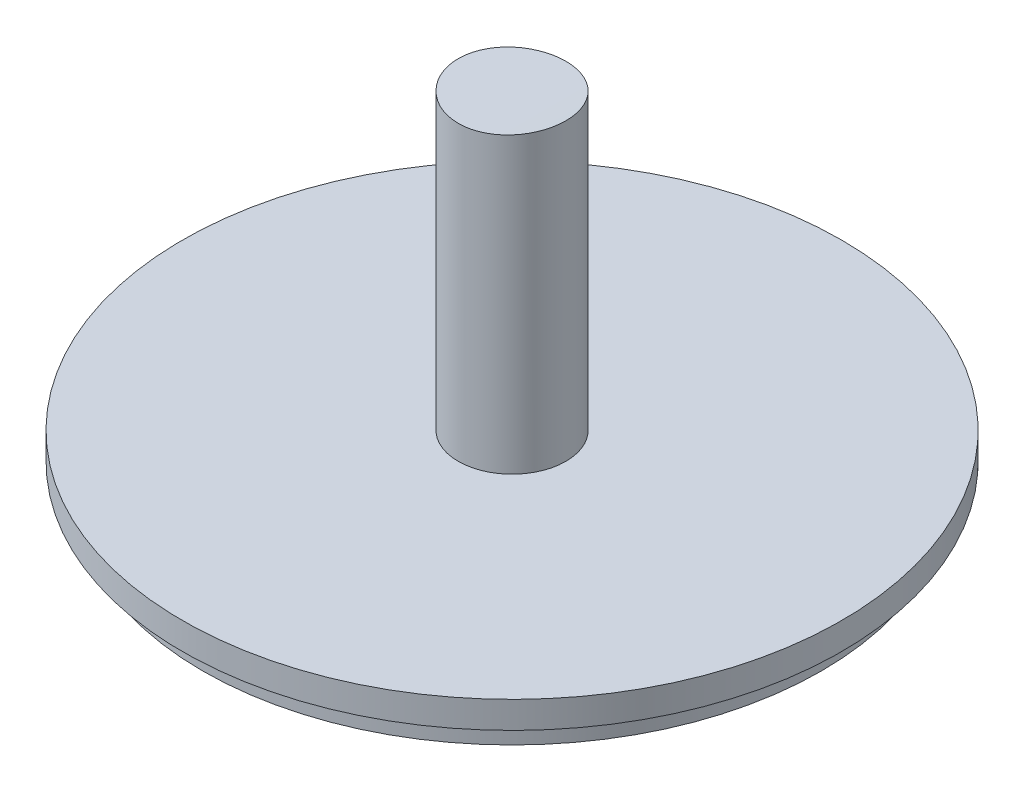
ISO-10303-21;
HEADER;
FILE_DESCRIPTION(('STEP AP214'),'2;1');
FILE_NAME('part.step','',(''),(''),'','','');
FILE_SCHEMA(('AUTOMOTIVE_DESIGN { 1 0 10303 214 1 1 1 1 }'));
ENDSEC;
DATA;
#1=APPLICATION_CONTEXT('core data for automotive mechanical design processes');
#2=APPLICATION_PROTOCOL_DEFINITION('international standard','automotive_design',2000,#1);
#3=PRODUCT_CONTEXT('',#1,'mechanical');
#4=PRODUCT('Part','Part','',(#3));
#5=PRODUCT_RELATED_PRODUCT_CATEGORY('part','',(#4));
#6=PRODUCT_DEFINITION_FORMATION('','',#4);
#7=PRODUCT_DEFINITION_CONTEXT('part definition',#1,'design');
#8=PRODUCT_DEFINITION('design','',#6,#7);
#9=PRODUCT_DEFINITION_SHAPE('','',#8);
#10=(LENGTH_UNIT() NAMED_UNIT(*) SI_UNIT(.MILLI.,.METRE.));
#11=(NAMED_UNIT(*) PLANE_ANGLE_UNIT() SI_UNIT($,.RADIAN.));
#12=(NAMED_UNIT(*) SI_UNIT($,.STERADIAN.) SOLID_ANGLE_UNIT());
#13=UNCERTAINTY_MEASURE_WITH_UNIT(LENGTH_MEASURE(1.E-05),#10,'distance_accuracy_value','');
#14=(GEOMETRIC_REPRESENTATION_CONTEXT(3) GLOBAL_UNCERTAINTY_ASSIGNED_CONTEXT((#13)) GLOBAL_UNIT_ASSIGNED_CONTEXT((#10,
#11,#12)) REPRESENTATION_CONTEXT('',''));
#15=CARTESIAN_POINT('',(0.,0.,0.));
#16=DIRECTION('',(0.,0.,1.));
#17=DIRECTION('',(1.,0.,0.));
#18=AXIS2_PLACEMENT_3D('',#15,#16,#17);
#19=CARTESIAN_POINT('',(0.,0.,0.));
#20=DIRECTION('',(0.,-1.,0.));
#21=DIRECTION('',(0.,0.,-1.));
#22=AXIS2_PLACEMENT_3D('',#19,#20,#21);
#23=PLANE('',#22);
#24=CARTESIAN_POINT('',(0.,0.,0.));
#25=DIRECTION('',(0.,-1.,0.));
#26=DIRECTION('',(0.,0.,-1.));
#27=AXIS2_PLACEMENT_3D('',#24,#25,#26);
#28=CIRCLE('',#27,72.9996);
#29=CARTESIAN_POINT('',(0.,0.,-72.9996));
#30=VERTEX_POINT('',#29);
#31=EDGE_CURVE('E43',#30,#30,#28,.T.);
#32=ORIENTED_EDGE('',*,*,#31,.T.);
#33=EDGE_LOOP('',(#32));
#34=FACE_BOUND('',#33,.T.);
#35=ADVANCED_FACE('F31',(#34),#23,.T.);
#36=CARTESIAN_POINT('',(0.,0.,0.));
#37=DIRECTION('',(0.,-1.,0.));
#38=DIRECTION('',(0.,0.,-1.));
#39=AXIS2_PLACEMENT_3D('',#36,#37,#38);
#40=CYLINDRICAL_SURFACE('',#39,72.9996);
#41=CARTESIAN_POINT('',(0.,6.35000000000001,0.));
#42=DIRECTION('',(0.,-1.,0.));
#43=DIRECTION('',(0.,0.,-1.));
#44=AXIS2_PLACEMENT_3D('',#41,#42,#43);
#45=CIRCLE('',#44,72.9996);
#46=CARTESIAN_POINT('',(0.,6.35000000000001,-72.9996));
#47=VERTEX_POINT('',#46);
#48=EDGE_CURVE('E48',#47,#47,#45,.T.);
#49=ORIENTED_EDGE('',*,*,#48,.T.);
#50=EDGE_LOOP('',(#49));
#51=FACE_BOUND('',#50,.T.);
#52=ORIENTED_EDGE('',*,*,#31,.F.);
#53=EDGE_LOOP('',(#52));
#54=FACE_BOUND('',#53,.T.);
#55=ADVANCED_FACE('F59',(#51,#54),#40,.T.);
#56=CARTESIAN_POINT('',(72.9996,6.35000000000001,0.));
#57=DIRECTION('',(0.,-1.,0.));
#58=DIRECTION('',(0.,0.,-1.));
#59=AXIS2_PLACEMENT_3D('',#56,#57,#58);
#60=PLANE('',#59);
#61=CARTESIAN_POINT('',(0.,6.35000000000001,0.));
#62=DIRECTION('',(0.,-1.,0.));
#63=DIRECTION('',(0.,0.,-1.));
#64=AXIS2_PLACEMENT_3D('',#61,#62,#63);
#65=CIRCLE('',#64,77.7748);
#66=CARTESIAN_POINT('',(0.,6.35000000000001,-77.7748));
#67=VERTEX_POINT('',#66);
#68=EDGE_CURVE('E53',#67,#67,#65,.T.);
#69=ORIENTED_EDGE('',*,*,#68,.T.);
#70=EDGE_LOOP('',(#69));
#71=FACE_BOUND('',#70,.T.);
#72=ORIENTED_EDGE('',*,*,#48,.F.);
#73=EDGE_LOOP('',(#72));
#74=FACE_BOUND('',#73,.T.);
#75=ADVANCED_FACE('F62',(#71,#74),#60,.T.);
#76=CARTESIAN_POINT('',(0.,0.,0.));
#77=DIRECTION('',(0.,-1.,0.));
#78=DIRECTION('',(0.,0.,-1.));
#79=AXIS2_PLACEMENT_3D('',#76,#77,#78);
#80=CYLINDRICAL_SURFACE('',#79,77.7748);
#81=CARTESIAN_POINT('',(0.,12.7,0.));
#82=DIRECTION('',(0.,-1.,0.));
#83=DIRECTION('',(0.,0.,-1.));
#84=AXIS2_PLACEMENT_3D('',#81,#82,#83);
#85=CIRCLE('',#84,77.7748);
#86=CARTESIAN_POINT('',(0.,12.7,-77.7748));
#87=VERTEX_POINT('',#86);
#88=EDGE_CURVE('E50',#87,#87,#85,.T.);
#89=ORIENTED_EDGE('',*,*,#88,.T.);
#90=EDGE_LOOP('',(#89));
#91=FACE_BOUND('',#90,.T.);
#92=ORIENTED_EDGE('',*,*,#68,.F.);
#93=EDGE_LOOP('',(#92));
#94=FACE_BOUND('',#93,.T.);
#95=ADVANCED_FACE('F64',(#91,#94),#80,.T.);
#96=CARTESIAN_POINT('',(77.7748,12.7,0.));
#97=DIRECTION('',(0.,1.,0.));
#98=DIRECTION('',(0.,0.,1.));
#99=AXIS2_PLACEMENT_3D('',#96,#97,#98);
#100=PLANE('',#99);
#101=CARTESIAN_POINT('',(0.,12.7,0.));
#102=DIRECTION('',(0.,1.,0.));
#103=DIRECTION('',(0.,0.,1.));
#104=AXIS2_PLACEMENT_3D('',#101,#102,#103);
#105=CIRCLE('',#104,12.7);
#106=CARTESIAN_POINT('',(0.,12.7,12.7));
#107=VERTEX_POINT('',#106);
#108=EDGE_CURVE('E10',#107,#107,#105,.T.);
#109=ORIENTED_EDGE('',*,*,#108,.F.);
#110=EDGE_LOOP('',(#109));
#111=FACE_BOUND('',#110,.T.);
#112=ORIENTED_EDGE('',*,*,#88,.F.);
#113=EDGE_LOOP('',(#112));
#114=FACE_BOUND('',#113,.T.);
#115=ADVANCED_FACE('F71',(#111,#114),#100,.T.);
#116=CARTESIAN_POINT('',(0.,88.9,0.));
#117=DIRECTION('',(0.,-1.,0.));
#118=DIRECTION('',(0.,0.,-1.));
#119=AXIS2_PLACEMENT_3D('',#116,#117,#118);
#120=CYLINDRICAL_SURFACE('',#119,12.7);
#121=CARTESIAN_POINT('',(0.,81.7753,-12.7));
#122=CARTESIAN_POINT('',(0.356124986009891,81.7752992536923,-12.7000032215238));
#123=CARTESIAN_POINT('',(0.712199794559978,81.7765708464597,-12.6850148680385));
#124=CARTESIAN_POINT('',(1.42192775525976,81.781620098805,-12.6251708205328));
#125=CARTESIAN_POINT('',(1.77558028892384,81.7853983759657,-12.5803077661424));
#126=CARTESIAN_POINT('',(2.47817873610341,81.795360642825,-12.4609688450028));
#127=CARTESIAN_POINT('',(2.82711954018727,81.8015470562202,-12.3864631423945));
#128=CARTESIAN_POINT('',(3.51745523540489,81.8161499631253,-12.2083812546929));
#129=CARTESIAN_POINT('',(3.85885014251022,81.8245664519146,-12.1048051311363));
#130=CARTESIAN_POINT('',(4.53147572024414,81.8433860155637,-11.8693983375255));
#131=CARTESIAN_POINT('',(4.86271215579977,81.8537879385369,-11.7375840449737));
#132=CARTESIAN_POINT('',(5.51289312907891,81.8762880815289,-11.4466091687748));
#133=CARTESIAN_POINT('',(5.83183748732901,81.8883863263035,-11.287448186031));
#134=CARTESIAN_POINT('',(6.45511408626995,81.913935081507,-10.942954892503));
#135=CARTESIAN_POINT('',(6.75944955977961,81.9273852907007,-10.7576284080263));
#136=CARTESIAN_POINT('',(7.35144734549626,81.9552614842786,-10.3620919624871));
#137=CARTESIAN_POINT('',(7.63910968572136,81.969687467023,-10.1518820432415));
#138=CARTESIAN_POINT('',(8.19639522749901,81.9991435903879,-9.70754354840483));
#139=CARTESIAN_POINT('',(8.465974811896,82.0141750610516,-9.47336035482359));
#140=CARTESIAN_POINT('',(8.98446070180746,82.0443854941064,-8.9831371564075));
#141=CARTESIAN_POINT('',(9.23336695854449,82.0595644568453,-8.72709710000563));
#142=CARTESIAN_POINT('',(9.70876155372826,82.089641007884,-8.19495264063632));
#143=CARTESIAN_POINT('',(9.93524891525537,82.1045385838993,-7.91884736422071));
#144=CARTESIAN_POINT('',(10.3641921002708,82.133629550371,-7.34852616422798));
#145=CARTESIAN_POINT('',(10.5666479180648,82.1478229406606,-7.05431023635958));
#146=CARTESIAN_POINT('',(10.9463775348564,82.1751232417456,-6.44938318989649));
#147=CARTESIAN_POINT('',(11.1236128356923,82.1882284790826,-6.13864782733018));
#148=CARTESIAN_POINT('',(11.4512689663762,82.2129545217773,-5.50328979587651));
#149=CARTESIAN_POINT('',(11.6016897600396,82.224575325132,-5.17866710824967));
#150=CARTESIAN_POINT('',(11.874631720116,82.2459998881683,-4.517844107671));
#151=CARTESIAN_POINT('',(11.997153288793,82.2558036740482,-4.18164396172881));
#152=CARTESIAN_POINT('',(12.2134120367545,82.2733132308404,-3.50005680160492));
#153=CARTESIAN_POINT('',(12.30714928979,82.2810190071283,-3.1546698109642));
#154=CARTESIAN_POINT('',(12.4649664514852,82.2940952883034,-2.45801960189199));
#155=CARTESIAN_POINT('',(12.5291174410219,82.2994713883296,-2.10677259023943));
#156=CARTESIAN_POINT('',(12.6276285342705,82.3077612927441,-1.40009665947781));
#157=CARTESIAN_POINT('',(12.6619886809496,82.3106751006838,-1.04466774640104));
#158=CARTESIAN_POINT('',(12.7006670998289,82.3139568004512,-0.332173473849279));
#159=CARTESIAN_POINT('',(12.7049858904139,82.3143247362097,0.0248918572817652));
#160=CARTESIAN_POINT('',(12.6835513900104,82.312504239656,0.738111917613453));
#161=CARTESIAN_POINT('',(12.6577981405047,82.3103158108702,1.09426664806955));
#162=CARTESIAN_POINT('',(12.5765134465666,82.3034543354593,1.80220009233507));
#163=CARTESIAN_POINT('',(12.5210594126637,82.2987877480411,2.15398776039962));
#164=CARTESIAN_POINT('',(12.3808243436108,82.2871070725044,2.85162762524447));
#165=CARTESIAN_POINT('',(12.2960433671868,82.2800929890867,3.19747983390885));
#166=CARTESIAN_POINT('',(12.0977655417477,82.2639169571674,3.88080293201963));
#167=CARTESIAN_POINT('',(11.9842684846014,82.2547549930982,4.21827376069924));
#168=CARTESIAN_POINT('',(11.7293736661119,82.234543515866,4.88245016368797));
#169=CARTESIAN_POINT('',(11.5879758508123,82.2234939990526,5.20915571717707));
#170=CARTESIAN_POINT('',(11.278089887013,82.1998053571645,5.84991467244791));
#171=CARTESIAN_POINT('',(11.1095671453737,82.1871642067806,6.163951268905));
#172=CARTESIAN_POINT('',(10.7467606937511,82.1606617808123,6.77671847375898));
#173=CARTESIAN_POINT('',(10.5524769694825,82.1468005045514,7.07544907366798));
#174=CARTESIAN_POINT('',(10.1395200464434,82.1182495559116,7.65551353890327));
#175=CARTESIAN_POINT('',(9.92084641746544,82.1035598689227,7.93684709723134));
#176=CARTESIAN_POINT('',(9.46065316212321,82.0737669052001,8.48014026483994));
#177=CARTESIAN_POINT('',(9.21913348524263,82.0586636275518,8.74209983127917));
#178=CARTESIAN_POINT('',(8.71414780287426,82.0284214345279,9.24560217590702));
#179=CARTESIAN_POINT('',(8.45061491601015,82.0132825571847,9.48707788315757));
#180=CARTESIAN_POINT('',(7.90412455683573,81.9834458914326,9.94697719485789));
#181=CARTESIAN_POINT('',(7.62116704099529,81.9687481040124,10.1654007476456));
#182=CARTESIAN_POINT('',(7.0378229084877,81.9402099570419,10.5776466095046));
#183=CARTESIAN_POINT('',(6.73743625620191,81.926369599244,10.7714688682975));
#184=CARTESIAN_POINT('',(6.12135596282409,81.899938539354,11.1331302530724));
#185=CARTESIAN_POINT('',(5.80566233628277,81.887347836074,11.3009694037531));
#186=CARTESIAN_POINT('',(5.16116552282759,81.8637717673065,11.6094798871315));
#187=CARTESIAN_POINT('',(4.83236084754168,81.8527865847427,11.7501481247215));
#188=CARTESIAN_POINT('',(4.16401037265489,81.8327351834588,12.0032790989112));
#189=CARTESIAN_POINT('',(3.8244645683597,81.8236689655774,12.1157418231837));
#190=CARTESIAN_POINT('',(3.13705723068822,81.807713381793,12.3116447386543));
#191=CARTESIAN_POINT('',(2.78919584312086,81.8008239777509,12.3950854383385));
#192=CARTESIAN_POINT('',(2.08763817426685,81.7894179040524,12.5323390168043));
#193=CARTESIAN_POINT('',(1.73394190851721,81.784901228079,12.5861519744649));
#194=CARTESIAN_POINT('',(1.02434653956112,81.7783793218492,12.663637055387));
#195=CARTESIAN_POINT('',(0.66845761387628,81.7763663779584,12.6874017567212));
#196=CARTESIAN_POINT('',(-0.0440630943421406,81.7748834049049,12.7049225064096));
#197=CARTESIAN_POINT('',(-0.400694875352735,81.775413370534,12.6986786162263));
#198=CARTESIAN_POINT('',(-1.11215428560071,81.7790011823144,12.6562279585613));
#199=CARTESIAN_POINT('',(-1.46698193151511,81.782059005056,12.6200214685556));
#200=CARTESIAN_POINT('',(-2.17230765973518,81.7906158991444,12.5179094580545));
#201=CARTESIAN_POINT('',(-2.52280574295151,81.7961149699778,12.4520039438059));
#202=CARTESIAN_POINT('',(-3.21646684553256,81.8093889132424,12.2910910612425));
#203=CARTESIAN_POINT('',(-3.55963991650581,81.8171604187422,12.1961267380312));
#204=CARTESIAN_POINT('',(-4.23675580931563,81.834763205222,11.9777478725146));
#205=CARTESIAN_POINT('',(-4.57069864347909,81.844594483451,11.8543333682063));
#206=CARTESIAN_POINT('',(-5.2270043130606,81.8660401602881,11.5799367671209));
#207=CARTESIAN_POINT('',(-5.54936700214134,81.8776545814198,11.4289543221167));
#208=CARTESIAN_POINT('',(-6.18024323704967,81.9023398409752,11.1004984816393));
#209=CARTESIAN_POINT('',(-6.48875674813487,81.9154106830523,10.9230250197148));
#210=CARTESIAN_POINT('',(-7.09050134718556,81.9426745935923,10.5423832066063));
#211=CARTESIAN_POINT('',(-7.38369356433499,81.9568703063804,10.3391535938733));
#212=CARTESIAN_POINT('',(-7.95192788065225,81.9859556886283,9.90877753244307));
#213=CARTESIAN_POINT('',(-8.22696995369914,82.0008453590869,9.68163104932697));
#214=CARTESIAN_POINT('',(-8.75697615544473,82.0308988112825,9.20501964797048));
#215=CARTESIAN_POINT('',(-9.01193996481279,82.0460625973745,8.95555437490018));
#216=CARTESIAN_POINT('',(-9.49999241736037,82.0762360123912,8.43606313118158));
#217=CARTESIAN_POINT('',(-9.73308103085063,82.0912456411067,8.16603713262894));
#218=CARTESIAN_POINT('',(-10.1763095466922,82.1207244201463,7.60660271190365));
#219=CARTESIAN_POINT('',(-10.386388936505,82.1351920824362,7.31714626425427));
#220=CARTESIAN_POINT('',(-10.781415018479,82.1631344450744,6.72151733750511));
#221=CARTESIAN_POINT('',(-10.9663616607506,82.1766091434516,6.41534482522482));
#222=CARTESIAN_POINT('',(-11.3097990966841,82.2021812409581,5.78845220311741));
#223=CARTESIAN_POINT('',(-11.4682900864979,82.2142786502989,5.46773220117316));
#224=CARTESIAN_POINT('',(-11.7576785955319,82.2367504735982,4.81401759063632));
#225=CARTESIAN_POINT('',(-11.8885761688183,82.2471248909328,4.48102300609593));
#226=CARTESIAN_POINT('',(-12.1216812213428,82.2658413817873,3.80556496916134));
#227=CARTESIAN_POINT('',(-12.2239255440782,82.2741860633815,3.46311430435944));
#228=CARTESIAN_POINT('',(-12.3992073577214,82.2886213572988,2.77077100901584));
#229=CARTESIAN_POINT('',(-12.4722448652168,82.2947119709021,2.42087838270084));
#230=CARTESIAN_POINT('',(-12.5885801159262,82.3044642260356,1.71615573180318));
#231=CARTESIAN_POINT('',(-12.6318783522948,82.3081259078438,1.36132578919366));
#232=CARTESIAN_POINT('',(-12.6884205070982,82.3129151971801,0.649262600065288));
#233=CARTESIAN_POINT('',(-12.7016644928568,82.3140428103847,0.292029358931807));
#234=CARTESIAN_POINT('',(-12.698007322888,82.3137320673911,-0.421153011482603));
#235=CARTESIAN_POINT('',(-12.6812011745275,82.3123017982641,-0.7771026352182));
#236=CARTESIAN_POINT('',(-12.617750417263,82.3069318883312,-1.48631256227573));
#237=CARTESIAN_POINT('',(-12.571105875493,82.302992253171,-1.83957287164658));
#238=CARTESIAN_POINT('',(-12.4483169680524,82.2927161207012,-2.54089292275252));
#239=CARTESIAN_POINT('',(-12.3721725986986,82.2863796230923,-2.88895266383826));
#240=CARTESIAN_POINT('',(-12.1909348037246,82.2714904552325,-3.57740293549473));
#241=CARTESIAN_POINT('',(-12.0858413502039,82.2629377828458,-3.91779345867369));
#242=CARTESIAN_POINT('',(-11.8474700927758,82.2438603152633,-4.58847501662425));
#243=CARTESIAN_POINT('',(-11.7141941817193,82.23333565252,-4.91876672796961));
#244=CARTESIAN_POINT('',(-11.4204079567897,82.2106126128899,-5.56694659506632));
#245=CARTESIAN_POINT('',(-11.2598976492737,82.1984142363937,-5.88483475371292));
#246=CARTESIAN_POINT('',(-10.9127881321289,82.1726894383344,-6.50596849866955));
#247=CARTESIAN_POINT('',(-10.7261894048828,82.1591630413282,-6.8092143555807));
#248=CARTESIAN_POINT('',(-10.3282213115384,82.1311641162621,-7.39894489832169));
#249=CARTESIAN_POINT('',(-10.1168519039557,82.1166915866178,-7.6854295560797));
#250=CARTESIAN_POINT('',(-9.67015771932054,82.0871638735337,-8.24046920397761));
#251=CARTESIAN_POINT('',(-9.43476260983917,82.0721070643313,-8.50896750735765));
#252=CARTESIAN_POINT('',(-8.94221016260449,82.0418782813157,-9.02519548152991));
#253=CARTESIAN_POINT('',(-8.68505270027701,82.0267063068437,-9.27292503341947));
#254=CARTESIAN_POINT('',(-8.15072151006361,81.996672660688,-9.74592631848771));
#255=CARTESIAN_POINT('',(-7.87354284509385,81.9818110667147,-9.97119247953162));
#256=CARTESIAN_POINT('',(-7.30118208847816,81.9528226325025,-10.3976003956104));
#257=CARTESIAN_POINT('',(-7.00600026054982,81.9386957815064,-10.5987425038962));
#258=CARTESIAN_POINT('',(-6.39912601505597,81.9115501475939,-10.975839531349));
#259=CARTESIAN_POINT('',(-6.08740297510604,81.8985335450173,-11.1517453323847));
#260=CARTESIAN_POINT('',(-5.45017924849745,81.8740086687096,-11.4766482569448));
#261=CARTESIAN_POINT('',(-5.12467853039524,81.8625003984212,-11.6256453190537));
#262=CARTESIAN_POINT('',(-4.46254522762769,81.8413304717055,-11.8955183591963));
#263=CARTESIAN_POINT('',(-4.12592441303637,81.8316669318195,-12.0164230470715));
#264=CARTESIAN_POINT('',(-3.44374950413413,81.8144484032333,-12.2294020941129));
#265=CARTESIAN_POINT('',(-3.09819767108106,81.8068928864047,-12.3214836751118));
#266=CARTESIAN_POINT('',(-2.29848676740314,81.7922343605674,-12.4988034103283));
#267=CARTESIAN_POINT('',(-1.84209282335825,81.7859084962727,-12.5741820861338));
#268=CARTESIAN_POINT('',(-0.923771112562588,81.7774418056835,-12.6747782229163));
#269=CARTESIAN_POINT('',(-0.461843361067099,81.7753009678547,-12.6999958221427));
#270=CARTESIAN_POINT('',(0.,81.7753,-12.7));
#271=B_SPLINE_CURVE_WITH_KNOTS('',3,(#121,#122,#123,#124,#125,#126,#127,#128,#129,#130,#131,
#132,#133,#134,#135,#136,#137,#138,#139,#140,#141,#142,#143,#144,#145,#146,#147,#148,#149,#150,
#151,#152,#153,#154,#155,#156,#157,#158,#159,#160,#161,#162,#163,#164,#165,#166,#167,#168,#169,
#170,#171,#172,#173,#174,#175,#176,#177,#178,#179,#180,#181,#182,#183,#184,#185,#186,#187,#188,
#189,#190,#191,#192,#193,#194,#195,#196,#197,#198,#199,#200,#201,#202,#203,#204,#205,#206,#207,
#208,#209,#210,#211,#212,#213,#214,#215,#216,#217,#218,#219,#220,#221,#222,#223,#224,#225,#226,
#227,#228,#229,#230,#231,#232,#233,#234,#235,#236,#237,#238,#239,#240,#241,#242,#243,#244,#245,
#246,#247,#248,#249,#250,#251,#252,#253,#254,#255,#256,#257,#258,#259,#260,#261,#262,#263,#264,
#265,#266,#267,#268,#269,#270),.UNSPECIFIED.,.T.,.F.,(4,2,2,2,2,2,2,2,2,2,2,2,2,2,2,2,2,2,2,2,2,
2,2,2,2,2,2,2,2,2,2,2,2,2,2,2,2,2,2,2,2,2,2,2,2,2,2,2,2,2,2,2,2,2,2,2,2,2,2,2,2,2,2,2,2,2,2,2,2,
2,2,2,2,2,4),(0.,1.06797121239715,2.1362056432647,3.20551800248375,4.27482809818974,
5.34351968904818,6.41222687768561,7.48069647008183,8.54916426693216,9.62012293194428,
10.6910841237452,11.7620919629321,12.8331000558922,13.9057258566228,14.9783531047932,
16.0509648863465,17.1235739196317,18.1935924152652,19.2636093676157,20.3336078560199,
21.4036048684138,22.4708265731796,23.5380461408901,24.6052734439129,25.6725028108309,
26.7411041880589,27.8097061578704,28.878326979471,29.9469501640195,31.0189471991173,
32.090946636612,33.1629482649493,34.2349488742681,35.3070715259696,36.3791946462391,
37.451298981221,38.5234004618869,39.592190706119,40.6609787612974,41.7297569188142,
42.7985348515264,43.8657371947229,44.9329381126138,46.0001525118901,47.067369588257,
48.1371744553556,49.2069808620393,50.2768042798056,51.3466291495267,52.4192032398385,
53.4917794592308,54.5643477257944,55.6369138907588,56.7080945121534,57.7792745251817,
58.8504367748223,59.921596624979,60.989375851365,62.0571526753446,63.1249296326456,
64.1927076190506,65.2604139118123,66.3281199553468,67.3958062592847,68.4634943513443,
69.5344028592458,70.60531749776,71.6764971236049,72.7476610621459,73.8208823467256,
74.8941060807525,75.9662281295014,77.0380813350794,78.4230916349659,79.8080981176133),.UNSPECIFIED.);
#272=CARTESIAN_POINT('',(0.,81.7753,-12.7));
#273=VERTEX_POINT('',#272);
#274=EDGE_CURVE('E34',#273,#273,#271,.T.);
#275=ORIENTED_EDGE('',*,*,#274,.T.);
#276=EDGE_LOOP('',(#275));
#277=FACE_BOUND('',#276,.T.);
#278=ORIENTED_EDGE('',*,*,#108,.T.);
#279=EDGE_LOOP('',(#278));
#280=FACE_BOUND('',#279,.T.);
#281=ADVANCED_FACE('F102',(#277,#280),#120,.T.);
#282=CARTESIAN_POINT('',(0.,231.775,-38.1));
#283=DIRECTION('',(0.,0.,1.));
#284=DIRECTION('',(1.,0.,0.));
#285=AXIS2_PLACEMENT_3D('',#282,#283,#284);
#286=CYLINDRICAL_SURFACE('',#285,149.9997);
#287=ORIENTED_EDGE('',*,*,#274,.F.);
#288=EDGE_LOOP('',(#287));
#289=FACE_BOUND('',#288,.T.);
#290=ADVANCED_FACE('F110',(#289),#286,.F.);
#291=CLOSED_SHELL('',(#35,#55,#75,#95,#115,#281,#290));
#292=MANIFOLD_SOLID_BREP('B2',#291);
#293=ADVANCED_BREP_SHAPE_REPRESENTATION('',(#18,#292),#14);
#294=SHAPE_DEFINITION_REPRESENTATION(#9,#293);
ENDSEC;
END-ISO-10303-21;
